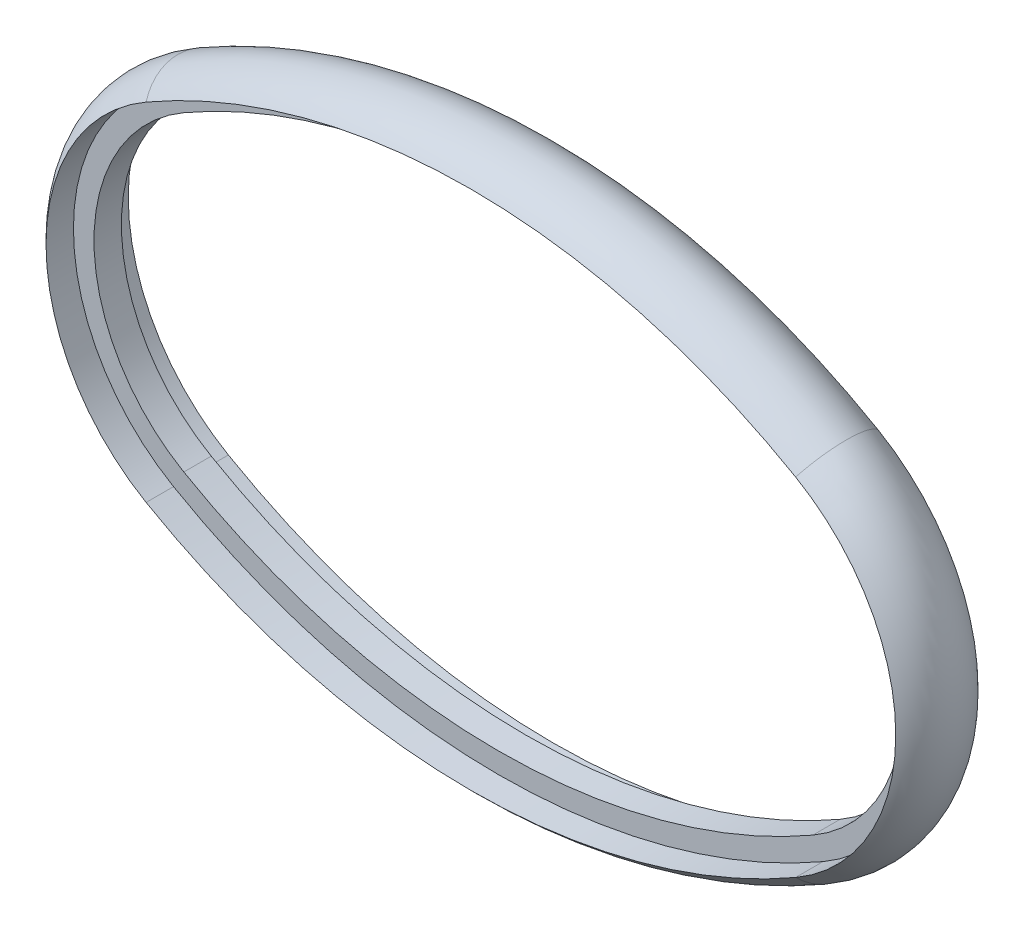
from build123d import *


with BuildPart() as part:
    # Balayage1: sweep along a path in Esquisse1
    with BuildLine(Plane.XY) as balayage1_path:
        ThreePointArc((23.696152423, -6.349364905), (0, 0), (-23.696152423, -6.349364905))
        ThreePointArc((-23.696152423, -6.349364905), (-31, -19), (-23.696152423, -31.650635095))
        ThreePointArc((-23.696152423, -31.650635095), (0, -38), (23.696152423, -31.650635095))
        ThreePointArc((23.696152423, -31.650635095), (31, -19), (23.696152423, -6.349364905))
    # Esquisse2 → Balayage1 (sweep)
    with BuildSketch(Plane(origin=(0, 0, 0), x_dir=(0, 0, -1), z_dir=(1, 0, 0))):
        with BuildLine():
            Line((-3, 0), (-1, 0))
            Line((-1, 0), (-1, -1.5))
            Line((-1, -1.5), (1, -1.5))
            Line((1, -1.5), (1, 0))
            Line((1, 0), (3, 0))
            ThreePointArc((3, 0), (0, 1.354248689), (-3, 0))
        make_face()
    sweep(path=balayage1_path.line)


solid = part.part
